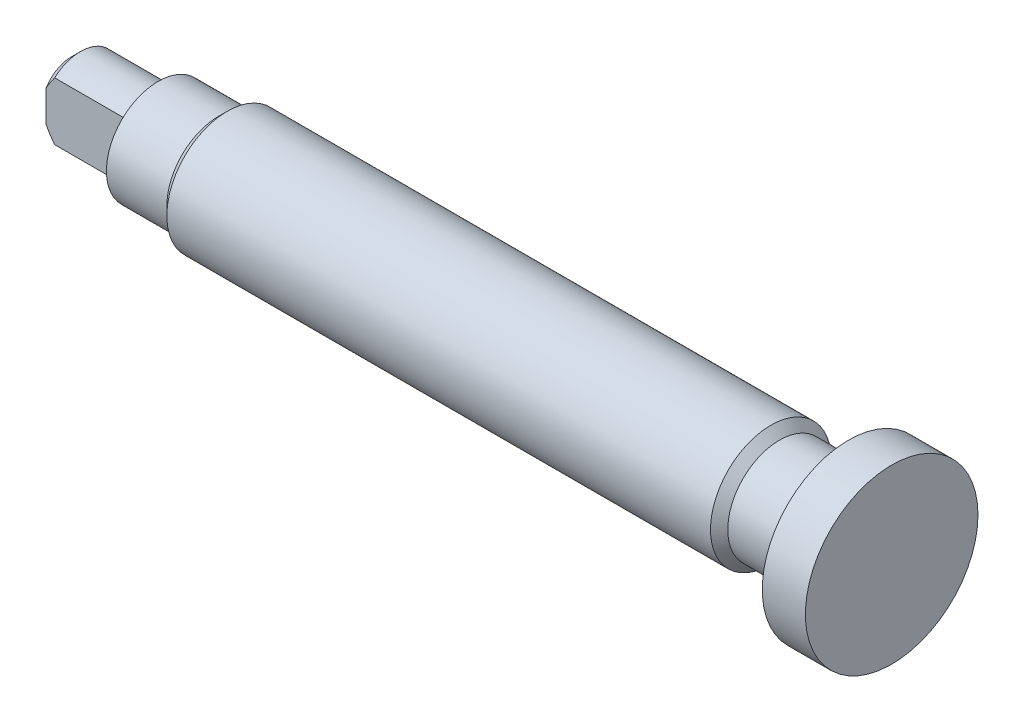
ISO-10303-21;
HEADER;
FILE_DESCRIPTION(('STEP AP214'),'2;1');
FILE_NAME('part.step','',(''),(''),'','','');
FILE_SCHEMA(('AUTOMOTIVE_DESIGN { 1 0 10303 214 1 1 1 1 }'));
ENDSEC;
DATA;
#1=APPLICATION_CONTEXT('core data for automotive mechanical design processes');
#2=APPLICATION_PROTOCOL_DEFINITION('international standard','automotive_design',2000,#1);
#3=PRODUCT_CONTEXT('',#1,'mechanical');
#4=PRODUCT('Part','Part','',(#3));
#5=PRODUCT_RELATED_PRODUCT_CATEGORY('part','',(#4));
#6=PRODUCT_DEFINITION_FORMATION('','',#4);
#7=PRODUCT_DEFINITION_CONTEXT('part definition',#1,'design');
#8=PRODUCT_DEFINITION('design','',#6,#7);
#9=PRODUCT_DEFINITION_SHAPE('','',#8);
#10=(LENGTH_UNIT() NAMED_UNIT(*) SI_UNIT(.MILLI.,.METRE.));
#11=(NAMED_UNIT(*) PLANE_ANGLE_UNIT() SI_UNIT($,.RADIAN.));
#12=(NAMED_UNIT(*) SI_UNIT($,.STERADIAN.) SOLID_ANGLE_UNIT());
#13=UNCERTAINTY_MEASURE_WITH_UNIT(LENGTH_MEASURE(1.E-05),#10,'distance_accuracy_value','');
#14=(GEOMETRIC_REPRESENTATION_CONTEXT(3) GLOBAL_UNCERTAINTY_ASSIGNED_CONTEXT((#13)) GLOBAL_UNIT_ASSIGNED_CONTEXT((#10,
#11,#12)) REPRESENTATION_CONTEXT('',''));
#15=CARTESIAN_POINT('',(0.,0.,0.));
#16=DIRECTION('',(0.,0.,1.));
#17=DIRECTION('',(1.,0.,0.));
#18=AXIS2_PLACEMENT_3D('',#15,#16,#17);
#19=CARTESIAN_POINT('',(201.774823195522,4.91246660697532,0.));
#20=DIRECTION('',(1.,0.,0.));
#21=DIRECTION('',(0.,0.,-1.));
#22=AXIS2_PLACEMENT_3D('',#19,#20,#21);
#23=PLANE('',#22);
#24=CARTESIAN_POINT('',(201.774823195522,-5.08753339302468,0.));
#25=DIRECTION('',(1.,0.,0.));
#26=DIRECTION('',(0.,0.,-1.));
#27=AXIS2_PLACEMENT_3D('',#24,#25,#26);
#28=CIRCLE('',#27,20.);
#29=CARTESIAN_POINT('',(201.774823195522,-5.08753339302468,-20.));
#30=VERTEX_POINT('',#29);
#31=EDGE_CURVE('E92',#30,#30,#28,.F.);
#32=ORIENTED_EDGE('',*,*,#31,.F.);
#33=EDGE_LOOP('',(#32));
#34=FACE_BOUND('',#33,.T.);
#35=ADVANCED_FACE('F16',(#34),#23,.T.);
#36=CARTESIAN_POINT('',(13.7748231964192,-5.08753339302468,0.));
#37=DIRECTION('',(1.,0.,0.));
#38=DIRECTION('',(0.,0.,-1.));
#39=AXIS2_PLACEMENT_3D('',#36,#37,#38);
#40=CONICAL_SURFACE('',#39,8.99999999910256,0.7853981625);
#41=CARTESIAN_POINT('',(13.7748231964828,1.62067053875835,6.00000000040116));
#42=CARTESIAN_POINT('',(13.6827667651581,1.49715737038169,6.0000000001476));
#43=CARTESIAN_POINT('',(13.5914310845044,1.37310991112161,6.00000000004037));
#44=CARTESIAN_POINT('',(13.4104113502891,1.12380604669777,5.99999999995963));
#45=CARTESIAN_POINT('',(13.3207273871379,0.998549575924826,5.99999999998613));
#46=CARTESIAN_POINT('',(13.0547789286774,0.62119588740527,6.0000000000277));
#47=CARTESIAN_POINT('',(12.8813097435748,0.36710377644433,6.00000000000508));
#48=CARTESIAN_POINT('',(12.6285183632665,-0.0190080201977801,5.99999999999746));
#49=CARTESIAN_POINT('',(12.5454617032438,-0.148587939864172,5.99999999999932));
#50=CARTESIAN_POINT('',(12.3822573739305,-0.409560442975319,6.00000000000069));
#51=CARTESIAN_POINT('',(12.3021095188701,-0.540952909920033,6.0000000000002));
#52=CARTESIAN_POINT('',(12.1450649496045,-0.805957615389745,5.99999999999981));
#53=CARTESIAN_POINT('',(12.0681736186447,-0.939573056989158,5.9999999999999));
#54=CARTESIAN_POINT('',(11.9183628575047,-1.20905022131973,6.0000000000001));
#55=CARTESIAN_POINT('',(11.8454443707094,-1.34491246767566,6.0000000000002));
#56=CARTESIAN_POINT('',(11.7748231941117,-1.4819821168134,6.));
#57=B_SPLINE_CURVE_WITH_KNOTS('',3,(#41,#42,#43,#44,#45,#46,#47,#48,#49,#50,#51,#52,#53,#54,#55,
#56),.UNSPECIFIED.,.F.,.F.,(4,2,2,2,2,2,2,4),(0.,0.46212617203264,0.924277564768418,
1.84704071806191,2.30875137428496,2.77043249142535,3.23284917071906,3.69537518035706),.UNSPECIFIED.);
#58=CARTESIAN_POINT('',(13.7748231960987,1.62067053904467,6.));
#59=VERTEX_POINT('',#58);
#60=CARTESIAN_POINT('',(11.774823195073,-1.48198211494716,6.));
#61=VERTEX_POINT('',#60);
#62=EDGE_CURVE('E97',#59,#61,#57,.T.);
#63=ORIENTED_EDGE('',*,*,#62,.F.);
#64=CARTESIAN_POINT('',(13.7748231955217,-5.08753339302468,0.));
#65=DIRECTION('',(1.,0.,0.));
#66=DIRECTION('',(0.,0.,-1.));
#67=AXIS2_PLACEMENT_3D('',#64,#65,#66);
#68=CIRCLE('',#67,9.);
#69=CARTESIAN_POINT('',(13.7748231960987,1.62067053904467,-6.));
#70=VERTEX_POINT('',#69);
#71=EDGE_CURVE('E83',#70,#59,#68,.T.);
#72=ORIENTED_EDGE('',*,*,#71,.F.);
#73=CARTESIAN_POINT('',(11.7748231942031,-1.48198211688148,-5.9999999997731));
#74=CARTESIAN_POINT('',(11.8454443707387,-1.34491246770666,-5.99999999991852));
#75=CARTESIAN_POINT('',(11.9183628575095,-1.20905022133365,-5.99999999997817));
#76=CARTESIAN_POINT('',(12.0681736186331,-0.93957305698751,-6.00000000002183));
#77=CARTESIAN_POINT('',(12.1450649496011,-0.805957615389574,-6.00000000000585));
#78=CARTESIAN_POINT('',(12.3021095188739,-0.540952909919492,-5.99999999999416));
#79=CARTESIAN_POINT('',(12.3822573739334,-0.409560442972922,-5.9999999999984));
#80=CARTESIAN_POINT('',(12.5454617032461,-0.148587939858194,-6.0000000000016));
#81=CARTESIAN_POINT('',(12.6285183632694,-0.0190080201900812,-6.00000000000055));
#82=CARTESIAN_POINT('',(12.881309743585,0.367103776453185,-5.9999999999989));
#83=CARTESIAN_POINT('',(13.0547789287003,0.621195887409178,-5.99999999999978));
#84=CARTESIAN_POINT('',(13.3207273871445,0.998549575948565,-6.00000000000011));
#85=CARTESIAN_POINT('',(13.4104113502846,1.12380604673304,-6.00000000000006));
#86=CARTESIAN_POINT('',(13.5914310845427,1.37310991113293,-5.99999999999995));
#87=CARTESIAN_POINT('',(13.6827667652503,1.49715737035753,-5.99999999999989));
#88=CARTESIAN_POINT('',(13.7748231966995,1.62067053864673,-6.));
#89=B_SPLINE_CURVE_WITH_KNOTS('',3,(#73,#74,#75,#76,#77,#78,#79,#80,#81,#82,#83,#84,#85,#86,#87,
#88),.UNSPECIFIED.,.F.,.F.,(4,2,2,2,2,2,2,4),(0.,0.462526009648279,0.924942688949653,
1.38662380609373,1.84833446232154,2.77109761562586,3.23324900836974,3.69537518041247),.UNSPECIFIED.);
#90=CARTESIAN_POINT('',(11.7748231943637,-1.48198211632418,-6.));
#91=VERTEX_POINT('',#90);
#92=EDGE_CURVE('E81',#91,#70,#89,.T.);
#93=ORIENTED_EDGE('',*,*,#92,.F.);
#94=CARTESIAN_POINT('',(11.7748231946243,-5.08753339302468,0.));
#95=DIRECTION('',(1.,0.,0.));
#96=DIRECTION('',(0.,0.,-1.));
#97=AXIS2_PLACEMENT_3D('',#94,#95,#96);
#98=CIRCLE('',#97,7.00000000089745);
#99=EDGE_CURVE('E21',#61,#91,#98,.F.);
#100=ORIENTED_EDGE('',*,*,#99,.F.);
#101=EDGE_LOOP('',(#63,#72,#93,#100));
#102=FACE_BOUND('',#101,.T.);
#103=ADVANCED_FACE('F82',(#102),#40,.T.);
#104=CARTESIAN_POINT('',(11.7748231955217,-0.587533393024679,0.));
#105=DIRECTION('',(-1.,0.,0.));
#106=DIRECTION('',(0.,0.,1.));
#107=AXIS2_PLACEMENT_3D('',#104,#105,#106);
#108=PLANE('',#107);
#109=DIRECTION('',(0.,1.,0.));
#110=VECTOR('',#109,1.);
#111=CARTESIAN_POINT('',(11.7748231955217,-5.20213924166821,6.));
#112=LINE('',#111,#110);
#113=CARTESIAN_POINT('',(11.7748231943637,-8.69308466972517,6.));
#114=VERTEX_POINT('',#113);
#115=EDGE_CURVE('E75',#61,#114,#112,.F.);
#116=ORIENTED_EDGE('',*,*,#115,.F.);
#117=ORIENTED_EDGE('',*,*,#99,.T.);
#118=DIRECTION('',(0.,1.,0.));
#119=VECTOR('',#118,1.);
#120=CARTESIAN_POINT('',(11.7748231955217,-5.08753339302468,-6.));
#121=LINE('',#120,#119);
#122=CARTESIAN_POINT('',(11.774823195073,-8.6930846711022,-6.));
#123=VERTEX_POINT('',#122);
#124=EDGE_CURVE('E72',#123,#91,#121,.T.);
#125=ORIENTED_EDGE('',*,*,#124,.F.);
#126=CARTESIAN_POINT('',(11.7748231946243,-5.08753339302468,0.));
#127=DIRECTION('',(1.,0.,0.));
#128=DIRECTION('',(0.,0.,-1.));
#129=AXIS2_PLACEMENT_3D('',#126,#127,#128);
#130=CIRCLE('',#129,7.00000000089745);
#131=EDGE_CURVE('E79',#114,#123,#130,.T.);
#132=ORIENTED_EDGE('',*,*,#131,.F.);
#133=EDGE_LOOP('',(#116,#117,#125,#132));
#134=FACE_BOUND('',#133,.T.);
#135=ADVANCED_FACE('F70',(#134),#108,.T.);
#136=CARTESIAN_POINT('',(13.7748231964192,-5.08753339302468,0.));
#137=DIRECTION('',(1.,0.,0.));
#138=DIRECTION('',(0.,0.,-1.));
#139=AXIS2_PLACEMENT_3D('',#136,#137,#138);
#140=CONICAL_SURFACE('',#139,8.99999999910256,0.7853981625);
#141=CARTESIAN_POINT('',(13.7748231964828,-11.7957373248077,-6.00000000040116));
#142=CARTESIAN_POINT('',(13.6827667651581,-11.6722241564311,-6.0000000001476));
#143=CARTESIAN_POINT('',(13.5914310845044,-11.548176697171,-6.00000000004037));
#144=CARTESIAN_POINT('',(13.4104113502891,-11.2988728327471,-5.99999999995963));
#145=CARTESIAN_POINT('',(13.3207273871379,-11.1736163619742,-5.99999999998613));
#146=CARTESIAN_POINT('',(13.0547789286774,-10.7962626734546,-6.0000000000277));
#147=CARTESIAN_POINT('',(12.8813097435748,-10.5421705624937,-6.00000000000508));
#148=CARTESIAN_POINT('',(12.6285183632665,-10.1560587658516,-5.99999999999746));
#149=CARTESIAN_POINT('',(12.5454617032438,-10.0264788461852,-5.99999999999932));
#150=CARTESIAN_POINT('',(12.3822573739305,-9.76550634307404,-6.00000000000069));
#151=CARTESIAN_POINT('',(12.3021095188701,-9.63411387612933,-6.0000000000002));
#152=CARTESIAN_POINT('',(12.1450649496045,-9.36910917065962,-5.99999999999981));
#153=CARTESIAN_POINT('',(12.0681736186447,-9.2354937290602,-5.9999999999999));
#154=CARTESIAN_POINT('',(11.9183628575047,-8.96601656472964,-6.0000000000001));
#155=CARTESIAN_POINT('',(11.8454443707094,-8.8301543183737,-6.0000000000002));
#156=CARTESIAN_POINT('',(11.7748231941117,-8.69308466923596,-6.));
#157=B_SPLINE_CURVE_WITH_KNOTS('',3,(#141,#142,#143,#144,#145,#146,#147,#148,#149,#150,#151,
#152,#153,#154,#155,#156),.UNSPECIFIED.,.F.,.F.,(4,2,2,2,2,2,2,4),(0.,0.462126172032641,
0.92427756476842,1.84704071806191,2.30875137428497,2.77043249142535,3.23284917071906,
3.69537518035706),.UNSPECIFIED.);
#158=CARTESIAN_POINT('',(13.7748231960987,-11.795737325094,-6.));
#159=VERTEX_POINT('',#158);
#160=EDGE_CURVE('E90',#159,#123,#157,.T.);
#161=ORIENTED_EDGE('',*,*,#160,.F.);
#162=CARTESIAN_POINT('',(13.7748231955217,-5.08753339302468,0.));
#163=DIRECTION('',(1.,0.,0.));
#164=DIRECTION('',(0.,0.,-1.));
#165=AXIS2_PLACEMENT_3D('',#162,#163,#164);
#166=CIRCLE('',#165,9.);
#167=CARTESIAN_POINT('',(13.7748231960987,-11.795737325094,6.));
#168=VERTEX_POINT('',#167);
#169=EDGE_CURVE('E122',#168,#159,#166,.T.);
#170=ORIENTED_EDGE('',*,*,#169,.F.);
#171=CARTESIAN_POINT('',(11.7748231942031,-8.69308466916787,5.9999999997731));
#172=CARTESIAN_POINT('',(11.8454443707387,-8.8301543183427,5.99999999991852));
#173=CARTESIAN_POINT('',(11.9183628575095,-8.9660165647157,5.99999999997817));
#174=CARTESIAN_POINT('',(12.0681736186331,-9.23549372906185,6.00000000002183));
#175=CARTESIAN_POINT('',(12.1450649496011,-9.36910917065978,6.00000000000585));
#176=CARTESIAN_POINT('',(12.3021095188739,-9.63411387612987,5.99999999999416));
#177=CARTESIAN_POINT('',(12.3822573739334,-9.76550634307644,5.9999999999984));
#178=CARTESIAN_POINT('',(12.5454617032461,-10.0264788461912,6.0000000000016));
#179=CARTESIAN_POINT('',(12.6285183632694,-10.1560587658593,6.00000000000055));
#180=CARTESIAN_POINT('',(12.881309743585,-10.5421705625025,5.9999999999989));
#181=CARTESIAN_POINT('',(13.0547789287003,-10.7962626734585,5.99999999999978));
#182=CARTESIAN_POINT('',(13.3207273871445,-11.1736163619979,6.00000000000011));
#183=CARTESIAN_POINT('',(13.4104113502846,-11.2988728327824,6.00000000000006));
#184=CARTESIAN_POINT('',(13.5914310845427,-11.5481766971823,5.99999999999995));
#185=CARTESIAN_POINT('',(13.6827667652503,-11.6722241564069,5.99999999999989));
#186=CARTESIAN_POINT('',(13.7748231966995,-11.7957373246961,6.));
#187=B_SPLINE_CURVE_WITH_KNOTS('',3,(#171,#172,#173,#174,#175,#176,#177,#178,#179,#180,#181,
#182,#183,#184,#185,#186),.UNSPECIFIED.,.F.,.F.,(4,2,2,2,2,2,2,4),(0.,0.462526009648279,
0.924942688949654,1.38662380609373,1.84833446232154,2.77109761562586,3.23324900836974,
3.69537518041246),.UNSPECIFIED.);
#188=EDGE_CURVE('E96',#114,#168,#187,.T.);
#189=ORIENTED_EDGE('',*,*,#188,.F.);
#190=ORIENTED_EDGE('',*,*,#131,.T.);
#191=EDGE_LOOP('',(#161,#170,#189,#190));
#192=FACE_BOUND('',#191,.T.);
#193=ADVANCED_FACE('F158',(#192),#140,.T.);
#194=CARTESIAN_POINT('',(196.774823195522,-5.08753339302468,0.));
#195=DIRECTION('',(1.,0.,0.));
#196=DIRECTION('',(0.,0.,-1.));
#197=AXIS2_PLACEMENT_3D('',#194,#195,#196);
#198=CYLINDRICAL_SURFACE('',#197,20.);
#199=ORIENTED_EDGE('',*,*,#31,.T.);
#200=EDGE_LOOP('',(#199));
#201=FACE_BOUND('',#200,.T.);
#202=CARTESIAN_POINT('',(191.774823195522,-5.08753339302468,0.));
#203=DIRECTION('',(1.,0.,0.));
#204=DIRECTION('',(0.,0.,-1.));
#205=AXIS2_PLACEMENT_3D('',#202,#203,#204);
#206=CIRCLE('',#205,20.);
#207=CARTESIAN_POINT('',(191.774823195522,-5.08753339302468,-20.));
#208=VERTEX_POINT('',#207);
#209=EDGE_CURVE('E107',#208,#208,#206,.F.);
#210=ORIENTED_EDGE('',*,*,#209,.F.);
#211=EDGE_LOOP('',(#210));
#212=FACE_BOUND('',#211,.T.);
#213=ADVANCED_FACE('F163',(#201,#212),#198,.T.);
#214=CARTESIAN_POINT('',(11.7748231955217,1.6206705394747,-6.));
#215=DIRECTION('',(0.,0.,-1.));
#216=DIRECTION('',(1.,0.,0.));
#217=AXIS2_PLACEMENT_3D('',#214,#215,#216);
#218=PLANE('',#217);
#219=DIRECTION('',(1.,0.,0.));
#220=VECTOR('',#219,1.);
#221=CARTESIAN_POINT('',(21.7748231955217,1.62067053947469,-6.));
#222=LINE('',#221,#220);
#223=CARTESIAN_POINT('',(31.7748231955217,1.62067053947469,-6.));
#224=VERTEX_POINT('',#223);
#225=EDGE_CURVE('E87',#224,#70,#222,.F.);
#226=ORIENTED_EDGE('',*,*,#225,.F.);
#227=DIRECTION('',(0.,1.,0.));
#228=VECTOR('',#227,1.);
#229=CARTESIAN_POINT('',(31.7748231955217,5.41246660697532,-6.));
#230=LINE('',#229,#228);
#231=CARTESIAN_POINT('',(31.7748231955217,-11.7957373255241,-6.));
#232=VERTEX_POINT('',#231);
#233=EDGE_CURVE('E105',#232,#224,#230,.T.);
#234=ORIENTED_EDGE('',*,*,#233,.F.);
#235=DIRECTION('',(1.,0.,0.));
#236=VECTOR('',#235,1.);
#237=CARTESIAN_POINT('',(21.7748231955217,-11.7957373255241,-6.));
#238=LINE('',#237,#236);
#239=EDGE_CURVE('E120',#159,#232,#238,.T.);
#240=ORIENTED_EDGE('',*,*,#239,.F.);
#241=ORIENTED_EDGE('',*,*,#160,.T.);
#242=ORIENTED_EDGE('',*,*,#124,.T.);
#243=ORIENTED_EDGE('',*,*,#92,.T.);
#244=EDGE_LOOP('',(#226,#234,#240,#241,#242,#243));
#245=FACE_BOUND('',#244,.T.);
#246=ADVANCED_FACE('F18',(#245),#218,.T.);
#247=CARTESIAN_POINT('',(21.7748231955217,-5.08753339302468,0.));
#248=DIRECTION('',(1.,0.,0.));
#249=DIRECTION('',(0.,0.,-1.));
#250=AXIS2_PLACEMENT_3D('',#247,#248,#249);
#251=CYLINDRICAL_SURFACE('',#250,9.);
#252=DIRECTION('',(1.,0.,0.));
#253=VECTOR('',#252,1.);
#254=CARTESIAN_POINT('',(20.2061225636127,1.62067053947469,6.));
#255=LINE('',#254,#253);
#256=CARTESIAN_POINT('',(31.7748231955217,1.62067053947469,6.));
#257=VERTEX_POINT('',#256);
#258=EDGE_CURVE('E98',#257,#59,#255,.F.);
#259=ORIENTED_EDGE('',*,*,#258,.F.);
#260=CARTESIAN_POINT('',(31.7748231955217,-5.08753339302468,0.));
#261=DIRECTION('',(1.,0.,0.));
#262=DIRECTION('',(0.,0.,-1.));
#263=AXIS2_PLACEMENT_3D('',#260,#261,#262);
#264=CIRCLE('',#263,9.);
#265=EDGE_CURVE('E104',#224,#257,#264,.T.);
#266=ORIENTED_EDGE('',*,*,#265,.F.);
#267=ORIENTED_EDGE('',*,*,#225,.T.);
#268=ORIENTED_EDGE('',*,*,#71,.T.);
#269=EDGE_LOOP('',(#259,#266,#267,#268));
#270=FACE_BOUND('',#269,.T.);
#271=ADVANCED_FACE('F179',(#270),#251,.T.);
#272=CARTESIAN_POINT('',(20.2061225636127,-5.20213924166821,6.));
#273=DIRECTION('',(0.,0.,1.));
#274=DIRECTION('',(1.,0.,0.));
#275=AXIS2_PLACEMENT_3D('',#272,#273,#274);
#276=PLANE('',#275);
#277=DIRECTION('',(1.,0.,0.));
#278=VECTOR('',#277,1.);
#279=CARTESIAN_POINT('',(21.7748231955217,-11.795737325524,6.));
#280=LINE('',#279,#278);
#281=CARTESIAN_POINT('',(31.7748231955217,-11.7957373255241,6.));
#282=VERTEX_POINT('',#281);
#283=EDGE_CURVE('E123',#282,#168,#280,.F.);
#284=ORIENTED_EDGE('',*,*,#283,.F.);
#285=DIRECTION('',(0.,1.,0.));
#286=VECTOR('',#285,1.);
#287=CARTESIAN_POINT('',(31.7748231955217,5.41246660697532,6.));
#288=LINE('',#287,#286);
#289=EDGE_CURVE('E101',#257,#282,#288,.F.);
#290=ORIENTED_EDGE('',*,*,#289,.F.);
#291=ORIENTED_EDGE('',*,*,#258,.T.);
#292=ORIENTED_EDGE('',*,*,#62,.T.);
#293=ORIENTED_EDGE('',*,*,#115,.T.);
#294=ORIENTED_EDGE('',*,*,#188,.T.);
#295=EDGE_LOOP('',(#284,#290,#291,#292,#293,#294));
#296=FACE_BOUND('',#295,.T.);
#297=ADVANCED_FACE('F154',(#296),#276,.T.);
#298=CARTESIAN_POINT('',(21.7748231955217,-5.08753339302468,0.));
#299=DIRECTION('',(1.,0.,0.));
#300=DIRECTION('',(0.,0.,-1.));
#301=AXIS2_PLACEMENT_3D('',#298,#299,#300);
#302=CYLINDRICAL_SURFACE('',#301,9.);
#303=ORIENTED_EDGE('',*,*,#239,.T.);
#304=CARTESIAN_POINT('',(31.7748231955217,-5.08753339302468,0.));
#305=DIRECTION('',(1.,0.,0.));
#306=DIRECTION('',(0.,0.,-1.));
#307=AXIS2_PLACEMENT_3D('',#304,#305,#306);
#308=CIRCLE('',#307,9.);
#309=EDGE_CURVE('E36',#282,#232,#308,.T.);
#310=ORIENTED_EDGE('',*,*,#309,.F.);
#311=ORIENTED_EDGE('',*,*,#283,.T.);
#312=ORIENTED_EDGE('',*,*,#169,.T.);
#313=EDGE_LOOP('',(#303,#310,#311,#312));
#314=FACE_BOUND('',#313,.T.);
#315=ADVANCED_FACE('F225',(#314),#302,.T.);
#316=CARTESIAN_POINT('',(191.774823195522,10.9124666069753,0.));
#317=DIRECTION('',(-1.,0.,0.));
#318=DIRECTION('',(0.,0.,1.));
#319=AXIS2_PLACEMENT_3D('',#316,#317,#318);
#320=PLANE('',#319);
#321=CARTESIAN_POINT('',(191.774823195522,-5.08753339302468,0.));
#322=DIRECTION('',(1.,0.,0.));
#323=DIRECTION('',(0.,0.,-1.));
#324=AXIS2_PLACEMENT_3D('',#321,#322,#323);
#325=CIRCLE('',#324,12.);
#326=CARTESIAN_POINT('',(191.774823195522,-5.08753339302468,-12.));
#327=VERTEX_POINT('',#326);
#328=EDGE_CURVE('E135',#327,#327,#325,.F.);
#329=ORIENTED_EDGE('',*,*,#328,.F.);
#330=EDGE_LOOP('',(#329));
#331=FACE_BOUND('',#330,.T.);
#332=ORIENTED_EDGE('',*,*,#209,.T.);
#333=EDGE_LOOP('',(#332));
#334=FACE_BOUND('',#333,.T.);
#335=ADVANCED_FACE('F186',(#331,#334),#320,.T.);
#336=CARTESIAN_POINT('',(31.7748231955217,5.41246660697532,0.));
#337=DIRECTION('',(-1.,0.,0.));
#338=DIRECTION('',(0.,0.,1.));
#339=AXIS2_PLACEMENT_3D('',#336,#337,#338);
#340=PLANE('',#339);
#341=ORIENTED_EDGE('',*,*,#289,.T.);
#342=ORIENTED_EDGE('',*,*,#309,.T.);
#343=ORIENTED_EDGE('',*,*,#233,.T.);
#344=ORIENTED_EDGE('',*,*,#265,.T.);
#345=EDGE_LOOP('',(#341,#342,#343,#344));
#346=FACE_BOUND('',#345,.T.);
#347=CARTESIAN_POINT('',(31.7748231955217,-5.08753339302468,0.));
#348=DIRECTION('',(1.,0.,0.));
#349=DIRECTION('',(0.,0.,-1.));
#350=AXIS2_PLACEMENT_3D('',#347,#348,#349);
#351=CIRCLE('',#350,12.);
#352=CARTESIAN_POINT('',(31.7748231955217,-5.08753339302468,-12.));
#353=VERTEX_POINT('',#352);
#354=EDGE_CURVE('E117',#353,#353,#351,.T.);
#355=ORIENTED_EDGE('',*,*,#354,.F.);
#356=EDGE_LOOP('',(#355));
#357=FACE_BOUND('',#356,.T.);
#358=ADVANCED_FACE('F182',(#346,#357),#340,.T.);
#359=CARTESIAN_POINT('',(183.774823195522,-5.08753339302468,0.));
#360=DIRECTION('',(1.,0.,0.));
#361=DIRECTION('',(0.,0.,-1.));
#362=AXIS2_PLACEMENT_3D('',#359,#360,#361);
#363=CYLINDRICAL_SURFACE('',#362,12.);
#364=ORIENTED_EDGE('',*,*,#328,.T.);
#365=EDGE_LOOP('',(#364));
#366=FACE_BOUND('',#365,.T.);
#367=CARTESIAN_POINT('',(175.774823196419,-5.08753339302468,0.));
#368=DIRECTION('',(-1.,0.,0.));
#369=DIRECTION('',(0.,-1.,0.));
#370=AXIS2_PLACEMENT_3D('',#367,#368,#369);
#371=CIRCLE('',#370,12.0000000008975);
#372=CARTESIAN_POINT('',(175.774823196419,-17.0875333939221,0.));
#373=VERTEX_POINT('',#372);
#374=EDGE_CURVE('E114',#373,#373,#371,.T.);
#375=ORIENTED_EDGE('',*,*,#374,.F.);
#376=EDGE_LOOP('',(#375));
#377=FACE_BOUND('',#376,.T.);
#378=ADVANCED_FACE('F185',(#366,#377),#363,.T.);
#379=CARTESIAN_POINT('',(39.7748231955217,-5.08753339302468,0.));
#380=DIRECTION('',(1.,0.,0.));
#381=DIRECTION('',(0.,0.,-1.));
#382=AXIS2_PLACEMENT_3D('',#379,#380,#381);
#383=CYLINDRICAL_SURFACE('',#382,12.);
#384=CARTESIAN_POINT('',(45.7748231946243,-5.08753339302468,0.));
#385=DIRECTION('',(1.,0.,0.));
#386=DIRECTION('',(0.,-1.,0.));
#387=AXIS2_PLACEMENT_3D('',#384,#385,#386);
#388=CIRCLE('',#387,12.0000000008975);
#389=CARTESIAN_POINT('',(45.7748231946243,-17.0875333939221,0.));
#390=VERTEX_POINT('',#389);
#391=EDGE_CURVE('E111',#390,#390,#388,.T.);
#392=ORIENTED_EDGE('',*,*,#391,.F.);
#393=EDGE_LOOP('',(#392));
#394=FACE_BOUND('',#393,.T.);
#395=ORIENTED_EDGE('',*,*,#354,.T.);
#396=EDGE_LOOP('',(#395));
#397=FACE_BOUND('',#396,.T.);
#398=ADVANCED_FACE('F190',(#394,#397),#383,.T.);
#399=CARTESIAN_POINT('',(173.774823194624,-5.08753339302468,0.));
#400=DIRECTION('',(-1.,0.,0.));
#401=DIRECTION('',(0.,0.,1.));
#402=AXIS2_PLACEMENT_3D('',#399,#400,#401);
#403=CONICAL_SURFACE('',#402,13.9999999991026,0.785398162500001);
#404=CARTESIAN_POINT('',(173.774823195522,-5.08753339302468,0.));
#405=DIRECTION('',(1.,0.,0.));
#406=DIRECTION('',(0.,0.,-1.));
#407=AXIS2_PLACEMENT_3D('',#404,#405,#406);
#408=CIRCLE('',#407,14.);
#409=CARTESIAN_POINT('',(173.774823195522,-5.08753339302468,-14.));
#410=VERTEX_POINT('',#409);
#411=EDGE_CURVE('E27',#410,#410,#408,.F.);
#412=ORIENTED_EDGE('',*,*,#411,.F.);
#413=EDGE_LOOP('',(#412));
#414=FACE_BOUND('',#413,.T.);
#415=ORIENTED_EDGE('',*,*,#374,.T.);
#416=EDGE_LOOP('',(#415));
#417=FACE_BOUND('',#416,.T.);
#418=ADVANCED_FACE('F192',(#414,#417),#403,.T.);
#419=CARTESIAN_POINT('',(47.7748231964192,-5.08753339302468,0.));
#420=DIRECTION('',(1.,0.,0.));
#421=DIRECTION('',(0.,0.,-1.));
#422=AXIS2_PLACEMENT_3D('',#419,#420,#421);
#423=CONICAL_SURFACE('',#422,13.9999999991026,0.785398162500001);
#424=ORIENTED_EDGE('',*,*,#391,.T.);
#425=EDGE_LOOP('',(#424));
#426=FACE_BOUND('',#425,.T.);
#427=CARTESIAN_POINT('',(47.7748231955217,-5.08753339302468,0.));
#428=DIRECTION('',(1.,0.,0.));
#429=DIRECTION('',(0.,0.,-1.));
#430=AXIS2_PLACEMENT_3D('',#427,#428,#429);
#431=CIRCLE('',#430,14.);
#432=CARTESIAN_POINT('',(47.7748231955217,-5.08753339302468,-14.));
#433=VERTEX_POINT('',#432);
#434=EDGE_CURVE('E10',#433,#433,#431,.T.);
#435=ORIENTED_EDGE('',*,*,#434,.F.);
#436=EDGE_LOOP('',(#435));
#437=FACE_BOUND('',#436,.T.);
#438=ADVANCED_FACE('F198',(#426,#437),#423,.T.);
#439=CARTESIAN_POINT('',(111.774823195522,-5.08753339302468,0.));
#440=DIRECTION('',(1.,0.,0.));
#441=DIRECTION('',(0.,0.,-1.));
#442=AXIS2_PLACEMENT_3D('',#439,#440,#441);
#443=CYLINDRICAL_SURFACE('',#442,14.);
#444=ORIENTED_EDGE('',*,*,#411,.T.);
#445=EDGE_LOOP('',(#444));
#446=FACE_BOUND('',#445,.T.);
#447=ORIENTED_EDGE('',*,*,#434,.T.);
#448=EDGE_LOOP('',(#447));
#449=FACE_BOUND('',#448,.T.);
#450=ADVANCED_FACE('F205',(#446,#449),#443,.T.);
#451=CLOSED_SHELL('',(#35,#103,#135,#193,#213,#246,#271,#297,#315,#335,#358,#378,#398,#418,#438,#450));
#452=MANIFOLD_SOLID_BREP('B1',#451);
#453=ADVANCED_BREP_SHAPE_REPRESENTATION('',(#18,#452),#14);
#454=SHAPE_DEFINITION_REPRESENTATION(#9,#453);
ENDSEC;
END-ISO-10303-21;
